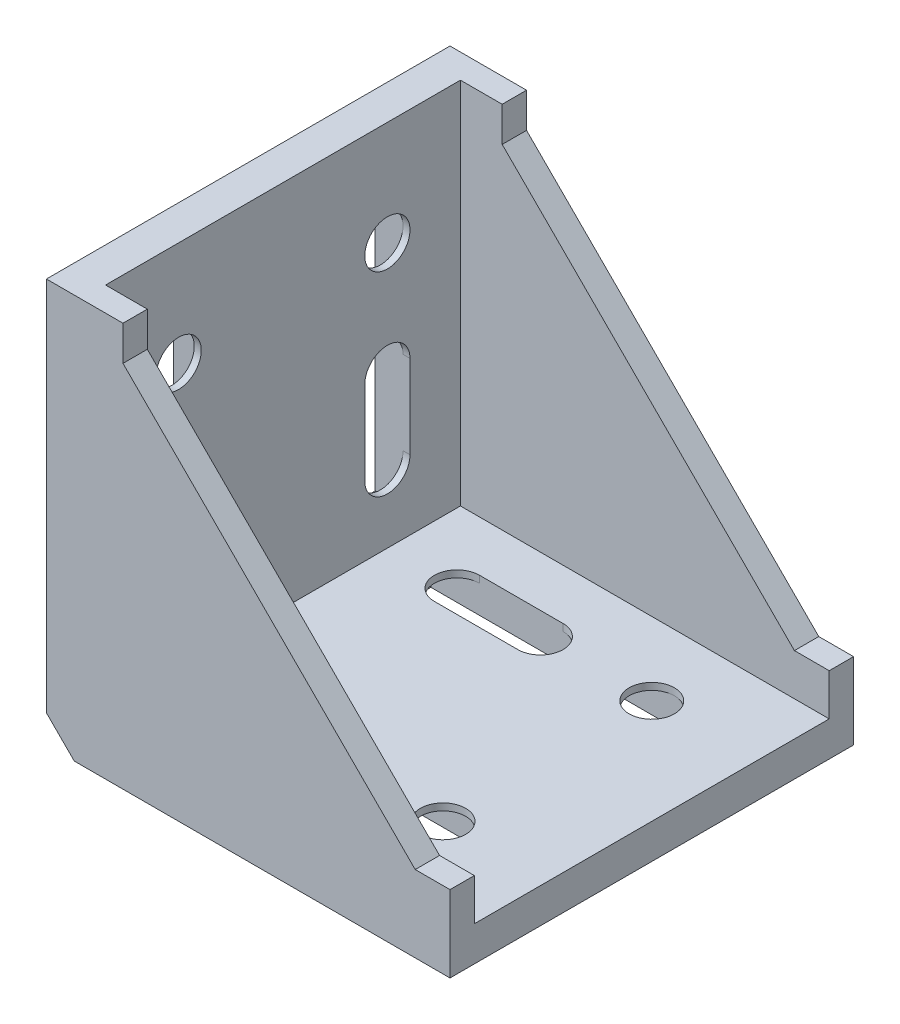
from build123d import *

# Parameters (mm, degrees)
EXTRUDE_1_DEPTH      = 29
EXTRUDE_1_DEPTH_BACK = 29
EXTRUDE_3_DEPTH      = 3.5
EXTRUDE_4_DEPTH      = 3.5
SKETCH_14_R          = 3.25
CUT_EXTRUDE_3_DEPTH  = 88
SKETCH_18_W          = 4
SKETCH_18_H          = 49.5
CUT_EXTRUDE_5_DEPTH  = 4
EXTRUDE_6_DEPTH      = 2
CUT_EXTRUDE_6_DEPTH  = 4
CHAMFER_1_SIZE       = 4


with BuildPart() as part:
    # Sketch 1 → Extrude 1 (new, two sides: drawn at the far end of the back side and taken through both)
    with BuildSketch(Plane.XY.offset(-EXTRUDE_1_DEPTH_BACK)):
        Polygon((0, 58), (5, 58), (5, 5), (58, 5), (58, 0), (0, 0), align=None)
    extrude(amount=EXTRUDE_1_DEPTH + EXTRUDE_1_DEPTH_BACK)

    # Sketch 3 → Extrude 3 (add)
    with BuildSketch(Plane.XY.offset(29)):
        Polygon((5, 58), (11, 58), (11, 53), (53, 11), (58, 11), (58, 5), (5, 5), align=None)
    extrude(amount=-EXTRUDE_3_DEPTH)

    # Sketch 6 → Extrude 4 (add)
    with BuildSketch(Plane(origin=(0, 0, -29), x_dir=(-1, 0, 0), z_dir=(0, 0, -1))):
        Polygon((-5, 58), (-11, 58), (-11, 53), (-53, 11), (-58, 11), (-58, 5), (-5, 5), align=None)
    extrude(amount=-EXTRUDE_4_DEPTH)

    # Sketch 14 → Cut-Extrude 3 (cut, through all)
    with BuildSketch(Plane.ZY):
        with Locations((-15, 43)):
            Circle(SKETCH_14_R)
        with Locations((15, 43)):
            Circle(SKETCH_14_R)
        with BuildLine():
            Line((11.75, 27), (11.75, 15))
            ThreePointArc((11.75, 15), (15, 11.75), (18.25, 15))
            Line((18.25, 15), (18.25, 27))
            ThreePointArc((18.25, 27), (15, 30.25), (11.75, 27))
        make_face()
        with BuildLine():
            Line((-11.75, 27), (-11.75, 15))
            ThreePointArc((-11.75, 15), (-15, 11.75), (-18.25, 15))
            Line((-18.25, 15), (-18.25, 27))
            ThreePointArc((-18.25, 27), (-15, 30.25), (-11.75, 27))
        make_face()
    cut_extrude_3 = extrude(amount=-CUT_EXTRUDE_3_DEPTH, mode=Mode.SUBTRACT)

    # Sketch 18 → Cut-Extrude 5 (cut)
    with BuildSketch(Plane.ZY):
        with Locations((-23.73840159, 29.75)):
            Rectangle(SKETCH_18_W, SKETCH_18_H)
        Polygon((-18.25, 43), (-18.25, 52), (-10.75, 52), (-10.75, 8), (-18.25, 8), align=None)
        Polygon((18.25, 43), (18.25, 8), (10.75, 8), (10.75, 52), (18.25, 52), align=None)
        with Locations((23.73840159, 29.75)):
            Rectangle(SKETCH_18_W, SKETCH_18_H)
    cut_extrude_5 = extrude(amount=-CUT_EXTRUDE_5_DEPTH, mode=Mode.SUBTRACT)

    # Sketch 19 → Extrude 6 (add)
    with BuildSketch(Plane.ZY):
        Polygon((-14.5, 52), (-12.5, 52), (-12.5, 54), (-17.5, 54), (-17.5, 52), align=None)
        Polygon((-14.5, 8), (-12.151822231, 8), (-12.151822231, 6), (-17.151822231, 6), (-17.151822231, 8), align=None)
        Polygon((17.151822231, 8), (14.5, 8), (12.151822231, 8), (12.151822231, 6), (17.151822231, 6), align=None)
        Polygon((17.5, 52), (14.5, 52), (12.5, 52), (12.5, 54), (17.5, 54), align=None)
    extrude_6 = extrude(amount=EXTRUDE_6_DEPTH)

    # Sketch 20 → Cut-Extrude 6 (cut)
    with BuildSketch(Plane.ZY):
        Polygon((0, 54.5), (8, 54.5), (8, 5.687531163), (-8, 5.687531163), (-8, 54.5), align=None)
    cut_extrude_6 = extrude(amount=-CUT_EXTRUDE_6_DEPTH, mode=Mode.SUBTRACT)

    # Mirror 5: Cut-Extrude 6 across plane
    add(cut_extrude_6.mirror(Plane(origin=(0, 0, 0), x_dir=(0, 0, 1), z_dir=(0.7071067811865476, -0.7071067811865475, 0))), mode=Mode.SUBTRACT)

    # Mirror 6: Cut-Extrude 5 across plane
    add(cut_extrude_5.mirror(Plane(origin=(0, 0, 0), x_dir=(0, 0, 1), z_dir=(0.7071067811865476, -0.7071067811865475, 0))), mode=Mode.SUBTRACT)

    # Mirror 7: Extrude 6 across plane
    add(extrude_6.mirror(Plane(origin=(0, 0, 0), x_dir=(0, 0, 1), z_dir=(0.7071067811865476, -0.7071067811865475, 0))))

    # Mirror 8: Cut-Extrude 3 across plane
    add(cut_extrude_3.mirror(Plane(origin=(0, 0, 0), x_dir=(0, 0, 1), z_dir=(0.7071067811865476, -0.7071067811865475, 0))), mode=Mode.SUBTRACT)

    # Chamfer 1
    chamfer_1_edges = [part.edges().sort_by_distance(p)[0] for p in [
        (0, 0, 0),
    ]]
    chamfer(chamfer_1_edges, length=CHAMFER_1_SIZE)


solid = part.part
